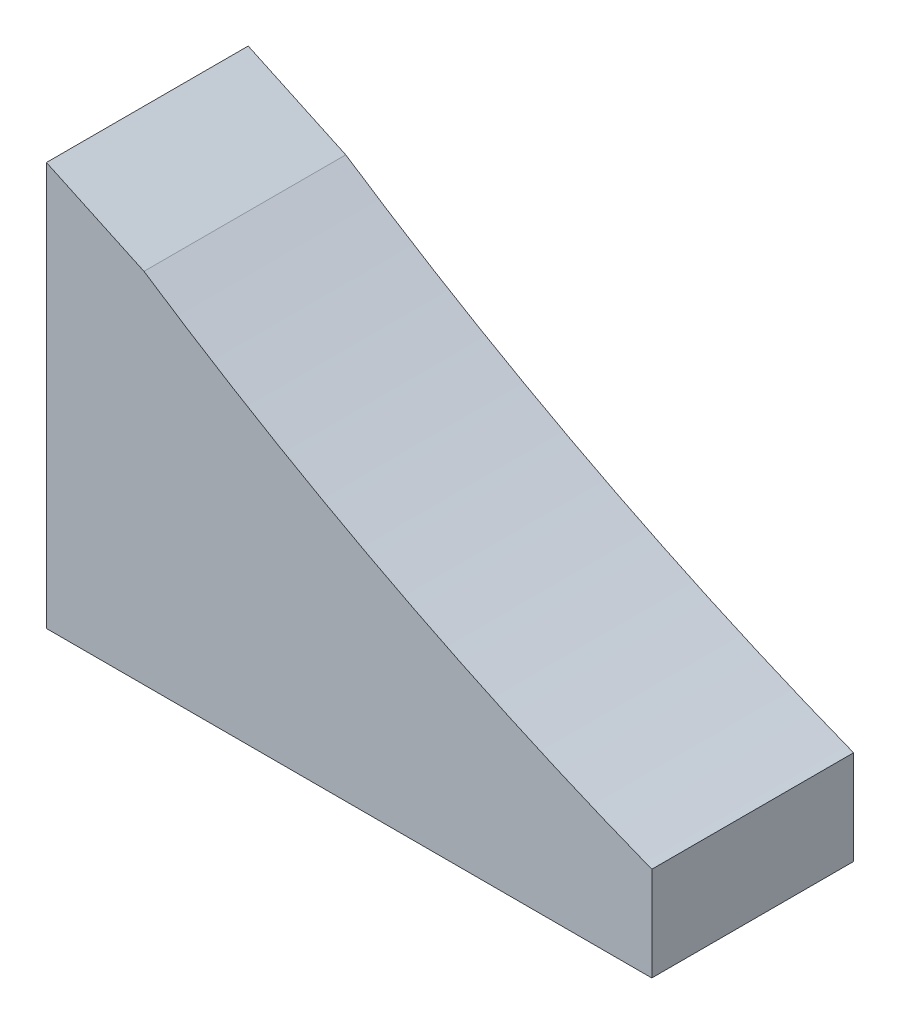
ISO-10303-21;
HEADER;
FILE_DESCRIPTION(('STEP AP214'),'2;1');
FILE_NAME('part.step','',(''),(''),'','','');
FILE_SCHEMA(('AUTOMOTIVE_DESIGN { 1 0 10303 214 1 1 1 1 }'));
ENDSEC;
DATA;
#1=APPLICATION_CONTEXT('core data for automotive mechanical design processes');
#2=APPLICATION_PROTOCOL_DEFINITION('international standard','automotive_design',2000,#1);
#3=PRODUCT_CONTEXT('',#1,'mechanical');
#4=PRODUCT('Part','Part','',(#3));
#5=PRODUCT_RELATED_PRODUCT_CATEGORY('part','',(#4));
#6=PRODUCT_DEFINITION_FORMATION('','',#4);
#7=PRODUCT_DEFINITION_CONTEXT('part definition',#1,'design');
#8=PRODUCT_DEFINITION('design','',#6,#7);
#9=PRODUCT_DEFINITION_SHAPE('','',#8);
#10=(LENGTH_UNIT() NAMED_UNIT(*) SI_UNIT(.MILLI.,.METRE.));
#11=(NAMED_UNIT(*) PLANE_ANGLE_UNIT() SI_UNIT($,.RADIAN.));
#12=(NAMED_UNIT(*) SI_UNIT($,.STERADIAN.) SOLID_ANGLE_UNIT());
#13=UNCERTAINTY_MEASURE_WITH_UNIT(LENGTH_MEASURE(1.E-05),#10,'distance_accuracy_value','');
#14=(GEOMETRIC_REPRESENTATION_CONTEXT(3) GLOBAL_UNCERTAINTY_ASSIGNED_CONTEXT((#13)) GLOBAL_UNIT_ASSIGNED_CONTEXT((#10,
#11,#12)) REPRESENTATION_CONTEXT('',''));
#15=CARTESIAN_POINT('',(0.,0.,0.));
#16=DIRECTION('',(0.,0.,1.));
#17=DIRECTION('',(1.,0.,0.));
#18=AXIS2_PLACEMENT_3D('',#15,#16,#17);
#19=CARTESIAN_POINT('',(-14.2875,19.05,-4.7625));
#20=DIRECTION('',(1.,0.,0.));
#21=DIRECTION('',(0.,0.,-1.));
#22=AXIS2_PLACEMENT_3D('',#19,#20,#21);
#23=PLANE('',#22);
#24=DIRECTION('',(0.,0.,1.));
#25=VECTOR('',#24,1.);
#26=CARTESIAN_POINT('',(-14.2875,0.,-4.7625));
#27=LINE('',#26,#25);
#28=CARTESIAN_POINT('',(-14.2875,0.,-4.7625));
#29=VERTEX_POINT('',#28);
#30=CARTESIAN_POINT('',(-14.2875,0.,4.7625));
#31=VERTEX_POINT('',#30);
#32=EDGE_CURVE('E88',#29,#31,#27,.T.);
#33=ORIENTED_EDGE('',*,*,#32,.T.);
#34=DIRECTION('',(0.,-1.,0.));
#35=VECTOR('',#34,1.);
#36=CARTESIAN_POINT('',(-14.2875,19.05,4.7625));
#37=LINE('',#36,#35);
#38=CARTESIAN_POINT('',(-14.2875,19.05,4.7625));
#39=VERTEX_POINT('',#38);
#40=EDGE_CURVE('E11',#39,#31,#37,.T.);
#41=ORIENTED_EDGE('',*,*,#40,.F.);
#42=DIRECTION('',(0.,0.,1.));
#43=VECTOR('',#42,1.);
#44=CARTESIAN_POINT('',(-14.2875,19.05,-4.7625));
#45=LINE('',#44,#43);
#46=CARTESIAN_POINT('',(-14.2875,19.05,-4.7625));
#47=VERTEX_POINT('',#46);
#48=EDGE_CURVE('E89',#47,#39,#45,.T.);
#49=ORIENTED_EDGE('',*,*,#48,.F.);
#50=DIRECTION('',(0.,-1.,0.));
#51=VECTOR('',#50,1.);
#52=CARTESIAN_POINT('',(-14.2875,19.05,-4.7625));
#53=LINE('',#52,#51);
#54=EDGE_CURVE('E75',#47,#29,#53,.T.);
#55=ORIENTED_EDGE('',*,*,#54,.T.);
#56=EDGE_LOOP('',(#33,#41,#49,#55));
#57=FACE_BOUND('',#56,.T.);
#58=ADVANCED_FACE('F32',(#57),#23,.F.);
#59=CARTESIAN_POINT('',(-14.2875,19.05,4.7625));
#60=DIRECTION('',(0.,0.,-1.));
#61=DIRECTION('',(-1.,0.,0.));
#62=AXIS2_PLACEMENT_3D('',#59,#60,#61);
#63=PLANE('',#62);
#64=DIRECTION('',(0.,-1.,0.));
#65=VECTOR('',#64,1.);
#66=CARTESIAN_POINT('',(14.2875,19.05,4.7625));
#67=LINE('',#66,#65);
#68=CARTESIAN_POINT('',(14.2875,4.44500000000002,4.7625));
#69=VERTEX_POINT('',#68);
#70=CARTESIAN_POINT('',(14.2875,0.,4.7625));
#71=VERTEX_POINT('',#70);
#72=EDGE_CURVE('E40',#69,#71,#67,.T.);
#73=ORIENTED_EDGE('',*,*,#72,.F.);
#74=CARTESIAN_POINT('',(60.5364637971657,122.724471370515,4.7625));
#75=DIRECTION('',(0.,0.,1.));
#76=DIRECTION('',(1.,0.,0.));
#77=AXIS2_PLACEMENT_3D('',#74,#75,#76);
#78=CIRCLE('',#77,127.);
#79=CARTESIAN_POINT('',(-9.68345644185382,16.9030992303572,4.7625));
#80=VERTEX_POINT('',#79);
#81=EDGE_CURVE('E99',#80,#69,#78,.T.);
#82=ORIENTED_EDGE('',*,*,#81,.F.);
#83=DIRECTION('',(0.90630778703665,-0.4226182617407,0.));
#84=VECTOR('',#83,1.);
#85=CARTESIAN_POINT('',(-14.2875,19.05,4.7625));
#86=LINE('',#85,#84);
#87=EDGE_CURVE('E104',#39,#80,#86,.T.);
#88=ORIENTED_EDGE('',*,*,#87,.F.);
#89=ORIENTED_EDGE('',*,*,#40,.T.);
#90=DIRECTION('',(1.,0.,0.));
#91=VECTOR('',#90,1.);
#92=CARTESIAN_POINT('',(-14.2875,0.,4.7625));
#93=LINE('',#92,#91);
#94=EDGE_CURVE('E83',#31,#71,#93,.T.);
#95=ORIENTED_EDGE('',*,*,#94,.T.);
#96=EDGE_LOOP('',(#73,#82,#88,#89,#95));
#97=FACE_BOUND('',#96,.T.);
#98=ADVANCED_FACE('F118',(#97),#63,.F.);
#99=CARTESIAN_POINT('',(14.2875,19.05,-4.7625));
#100=DIRECTION('',(-1.,0.,0.));
#101=DIRECTION('',(0.,0.,1.));
#102=AXIS2_PLACEMENT_3D('',#99,#100,#101);
#103=PLANE('',#102);
#104=DIRECTION('',(0.,-1.,0.));
#105=VECTOR('',#104,1.);
#106=CARTESIAN_POINT('',(14.2875,19.05,-4.7625));
#107=LINE('',#106,#105);
#108=CARTESIAN_POINT('',(14.2875,4.44500000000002,-4.7625));
#109=VERTEX_POINT('',#108);
#110=CARTESIAN_POINT('',(14.2875,0.,-4.7625));
#111=VERTEX_POINT('',#110);
#112=EDGE_CURVE('E65',#109,#111,#107,.T.);
#113=ORIENTED_EDGE('',*,*,#112,.F.);
#114=DIRECTION('',(0.,0.,1.));
#115=VECTOR('',#114,1.);
#116=CARTESIAN_POINT('',(14.2875,4.44500000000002,-4.7625));
#117=LINE('',#116,#115);
#118=EDGE_CURVE('E113',#109,#69,#117,.T.);
#119=ORIENTED_EDGE('',*,*,#118,.T.);
#120=ORIENTED_EDGE('',*,*,#72,.T.);
#121=DIRECTION('',(0.,0.,-1.));
#122=VECTOR('',#121,1.);
#123=CARTESIAN_POINT('',(14.2875,0.,-4.7625));
#124=LINE('',#123,#122);
#125=EDGE_CURVE('E78',#71,#111,#124,.T.);
#126=ORIENTED_EDGE('',*,*,#125,.T.);
#127=EDGE_LOOP('',(#113,#119,#120,#126));
#128=FACE_BOUND('',#127,.T.);
#129=ADVANCED_FACE('F79',(#128),#103,.F.);
#130=CARTESIAN_POINT('',(-14.2875,19.05,-4.7625));
#131=DIRECTION('',(0.,0.,1.));
#132=DIRECTION('',(1.,0.,0.));
#133=AXIS2_PLACEMENT_3D('',#130,#131,#132);
#134=PLANE('',#133);
#135=DIRECTION('',(0.90630778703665,-0.4226182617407,0.));
#136=VECTOR('',#135,1.);
#137=CARTESIAN_POINT('',(-14.2875,19.05,-4.7625));
#138=LINE('',#137,#136);
#139=CARTESIAN_POINT('',(-9.68345644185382,16.9030992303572,-4.7625));
#140=VERTEX_POINT('',#139);
#141=EDGE_CURVE('E47',#47,#140,#138,.T.);
#142=ORIENTED_EDGE('',*,*,#141,.T.);
#143=CARTESIAN_POINT('',(60.5364637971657,122.724471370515,-4.7625));
#144=DIRECTION('',(0.,0.,1.));
#145=DIRECTION('',(1.,0.,0.));
#146=AXIS2_PLACEMENT_3D('',#143,#144,#145);
#147=CIRCLE('',#146,127.);
#148=EDGE_CURVE('E72',#140,#109,#147,.T.);
#149=ORIENTED_EDGE('',*,*,#148,.T.);
#150=ORIENTED_EDGE('',*,*,#112,.T.);
#151=DIRECTION('',(-1.,0.,0.));
#152=VECTOR('',#151,1.);
#153=CARTESIAN_POINT('',(-14.2875,0.,-4.7625));
#154=LINE('',#153,#152);
#155=EDGE_CURVE('E69',#111,#29,#154,.T.);
#156=ORIENTED_EDGE('',*,*,#155,.T.);
#157=ORIENTED_EDGE('',*,*,#54,.F.);
#158=EDGE_LOOP('',(#142,#149,#150,#156,#157));
#159=FACE_BOUND('',#158,.T.);
#160=ADVANCED_FACE('F67',(#159),#134,.F.);
#161=CARTESIAN_POINT('',(-14.2875,0.,4.7625));
#162=DIRECTION('',(0.,1.,0.));
#163=DIRECTION('',(0.,0.,1.));
#164=AXIS2_PLACEMENT_3D('',#161,#162,#163);
#165=PLANE('',#164);
#166=CARTESIAN_POINT('',(9.525,0.,0.));
#167=DIRECTION('',(0.,-1.,0.));
#168=DIRECTION('',(0.,0.,-1.));
#169=AXIS2_PLACEMENT_3D('',#166,#167,#168);
#170=CIRCLE('',#169,1.905);
#171=CARTESIAN_POINT('',(9.525,0.,-1.905));
#172=VERTEX_POINT('',#171);
#173=EDGE_CURVE('E158',#172,#172,#170,.T.);
#174=ORIENTED_EDGE('',*,*,#173,.F.);
#175=EDGE_LOOP('',(#174));
#176=FACE_BOUND('',#175,.T.);
#177=CARTESIAN_POINT('',(-9.525,0.,0.));
#178=DIRECTION('',(0.,-1.,0.));
#179=DIRECTION('',(0.,0.,-1.));
#180=AXIS2_PLACEMENT_3D('',#177,#178,#179);
#181=CIRCLE('',#180,1.905);
#182=CARTESIAN_POINT('',(-9.525,0.,-1.905));
#183=VERTEX_POINT('',#182);
#184=EDGE_CURVE('E107',#183,#183,#181,.T.);
#185=ORIENTED_EDGE('',*,*,#184,.F.);
#186=EDGE_LOOP('',(#185));
#187=FACE_BOUND('',#186,.T.);
#188=ORIENTED_EDGE('',*,*,#32,.F.);
#189=ORIENTED_EDGE('',*,*,#155,.F.);
#190=ORIENTED_EDGE('',*,*,#125,.F.);
#191=ORIENTED_EDGE('',*,*,#94,.F.);
#192=EDGE_LOOP('',(#188,#189,#190,#191));
#193=FACE_BOUND('',#192,.T.);
#194=ADVANCED_FACE('F86',(#176,#187,#193),#165,.F.);
#195=CARTESIAN_POINT('',(60.5364637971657,122.724471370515,-4.7625));
#196=DIRECTION('',(0.,0.,1.));
#197=DIRECTION('',(1.,0.,0.));
#198=AXIS2_PLACEMENT_3D('',#195,#196,#197);
#199=CYLINDRICAL_SURFACE('',#198,127.);
#200=ORIENTED_EDGE('',*,*,#81,.T.);
#201=ORIENTED_EDGE('',*,*,#118,.F.);
#202=ORIENTED_EDGE('',*,*,#148,.F.);
#203=DIRECTION('',(0.,0.,1.));
#204=VECTOR('',#203,1.);
#205=CARTESIAN_POINT('',(-9.68345644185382,16.9030992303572,-4.7625));
#206=LINE('',#205,#204);
#207=EDGE_CURVE('E101',#140,#80,#206,.T.);
#208=ORIENTED_EDGE('',*,*,#207,.T.);
#209=EDGE_LOOP('',(#200,#201,#202,#208));
#210=FACE_BOUND('',#209,.T.);
#211=ADVANCED_FACE('F127',(#210),#199,.F.);
#212=CARTESIAN_POINT('',(-14.2875,19.05,-4.7625));
#213=DIRECTION('',(-0.4226182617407,-0.90630778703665,0.));
#214=DIRECTION('',(0.90630778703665,-0.4226182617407,0.));
#215=AXIS2_PLACEMENT_3D('',#212,#213,#214);
#216=PLANE('',#215);
#217=ORIENTED_EDGE('',*,*,#87,.T.);
#218=ORIENTED_EDGE('',*,*,#207,.F.);
#219=ORIENTED_EDGE('',*,*,#141,.F.);
#220=ORIENTED_EDGE('',*,*,#48,.T.);
#221=EDGE_LOOP('',(#217,#218,#219,#220));
#222=FACE_BOUND('',#221,.T.);
#223=ADVANCED_FACE('F128',(#222),#216,.F.);
#224=CARTESIAN_POINT('',(-9.525,5.08,0.));
#225=DIRECTION('',(0.,-1.,0.));
#226=DIRECTION('',(0.,0.,-1.));
#227=AXIS2_PLACEMENT_3D('',#224,#225,#226);
#228=CYLINDRICAL_SURFACE('',#227,1.905);
#229=CARTESIAN_POINT('',(-9.525,5.08,0.));
#230=DIRECTION('',(0.,-1.,0.));
#231=DIRECTION('',(0.,0.,-1.));
#232=AXIS2_PLACEMENT_3D('',#229,#230,#231);
#233=CIRCLE('',#232,1.905);
#234=CARTESIAN_POINT('',(-9.525,5.08,-1.905));
#235=VERTEX_POINT('',#234);
#236=EDGE_CURVE('E111',#235,#235,#233,.T.);
#237=ORIENTED_EDGE('',*,*,#236,.F.);
#238=EDGE_LOOP('',(#237));
#239=FACE_BOUND('',#238,.T.);
#240=ORIENTED_EDGE('',*,*,#184,.T.);
#241=EDGE_LOOP('',(#240));
#242=FACE_BOUND('',#241,.T.);
#243=ADVANCED_FACE('F130',(#239,#242),#228,.F.);
#244=CARTESIAN_POINT('',(-9.525,5.08,0.));
#245=DIRECTION('',(0.,-1.,0.));
#246=DIRECTION('',(0.,0.,-1.));
#247=AXIS2_PLACEMENT_3D('',#244,#245,#246);
#248=PLANE('',#247);
#249=ORIENTED_EDGE('',*,*,#236,.T.);
#250=EDGE_LOOP('',(#249));
#251=FACE_BOUND('',#250,.T.);
#252=ADVANCED_FACE('F136',(#251),#248,.T.);
#253=CARTESIAN_POINT('',(9.525,5.08,0.));
#254=DIRECTION('',(0.,-1.,0.));
#255=DIRECTION('',(0.,0.,-1.));
#256=AXIS2_PLACEMENT_3D('',#253,#254,#255);
#257=CYLINDRICAL_SURFACE('',#256,1.905);
#258=CARTESIAN_POINT('',(9.525,5.08,0.));
#259=DIRECTION('',(0.,-1.,0.));
#260=DIRECTION('',(0.,0.,-1.));
#261=AXIS2_PLACEMENT_3D('',#258,#259,#260);
#262=CIRCLE('',#261,1.905);
#263=CARTESIAN_POINT('',(9.525,5.08,-1.905));
#264=VERTEX_POINT('',#263);
#265=EDGE_CURVE('E162',#264,#264,#262,.T.);
#266=ORIENTED_EDGE('',*,*,#265,.F.);
#267=EDGE_LOOP('',(#266));
#268=FACE_BOUND('',#267,.T.);
#269=ORIENTED_EDGE('',*,*,#173,.T.);
#270=EDGE_LOOP('',(#269));
#271=FACE_BOUND('',#270,.T.);
#272=ADVANCED_FACE('F170',(#268,#271),#257,.F.);
#273=CARTESIAN_POINT('',(9.525,5.08,0.));
#274=DIRECTION('',(0.,-1.,0.));
#275=DIRECTION('',(0.,0.,-1.));
#276=AXIS2_PLACEMENT_3D('',#273,#274,#275);
#277=PLANE('',#276);
#278=ORIENTED_EDGE('',*,*,#265,.T.);
#279=EDGE_LOOP('',(#278));
#280=FACE_BOUND('',#279,.T.);
#281=ADVANCED_FACE('F172',(#280),#277,.T.);
#282=CLOSED_SHELL('',(#58,#98,#129,#160,#194,#211,#223,#243,#252,#272,#281));
#283=MANIFOLD_SOLID_BREP('B2',#282);
#284=ADVANCED_BREP_SHAPE_REPRESENTATION('',(#18,#283),#14);
#285=SHAPE_DEFINITION_REPRESENTATION(#9,#284);
ENDSEC;
END-ISO-10303-21;
